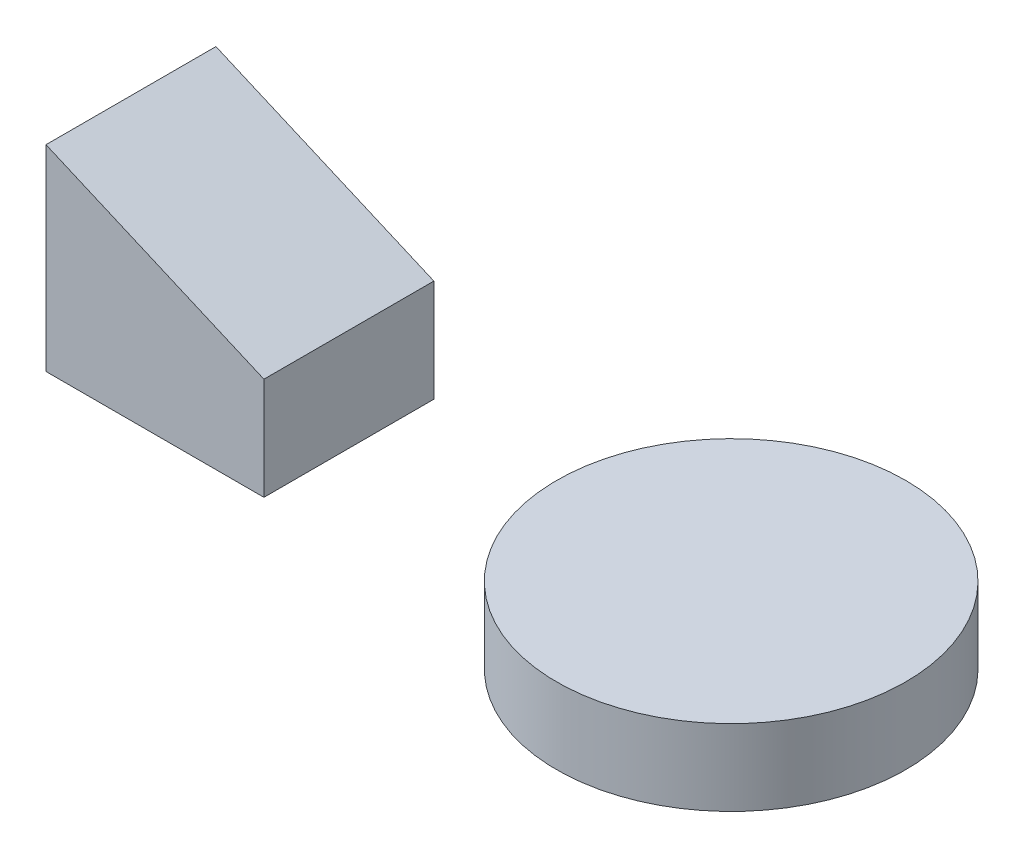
ISO-10303-21;
HEADER;
FILE_DESCRIPTION(('STEP AP214'),'2;1');
FILE_NAME('part.step','',(''),(''),'','','');
FILE_SCHEMA(('AUTOMOTIVE_DESIGN { 1 0 10303 214 1 1 1 1 }'));
ENDSEC;
DATA;
#1=APPLICATION_CONTEXT('core data for automotive mechanical design processes');
#2=APPLICATION_PROTOCOL_DEFINITION('international standard','automotive_design',2000,#1);
#3=PRODUCT_CONTEXT('',#1,'mechanical');
#4=PRODUCT('Part','Part','',(#3));
#5=PRODUCT_RELATED_PRODUCT_CATEGORY('part','',(#4));
#6=PRODUCT_DEFINITION_FORMATION('','',#4);
#7=PRODUCT_DEFINITION_CONTEXT('part definition',#1,'design');
#8=PRODUCT_DEFINITION('design','',#6,#7);
#9=PRODUCT_DEFINITION_SHAPE('','',#8);
#10=(LENGTH_UNIT() NAMED_UNIT(*) SI_UNIT(.MILLI.,.METRE.));
#11=(NAMED_UNIT(*) PLANE_ANGLE_UNIT() SI_UNIT($,.RADIAN.));
#12=(NAMED_UNIT(*) SI_UNIT($,.STERADIAN.) SOLID_ANGLE_UNIT());
#13=UNCERTAINTY_MEASURE_WITH_UNIT(LENGTH_MEASURE(1.E-05),#10,'distance_accuracy_value','');
#14=(GEOMETRIC_REPRESENTATION_CONTEXT(3) GLOBAL_UNCERTAINTY_ASSIGNED_CONTEXT((#13)) GLOBAL_UNIT_ASSIGNED_CONTEXT((#10,
#11,#12)) REPRESENTATION_CONTEXT('',''));
#15=CARTESIAN_POINT('',(0.,0.,0.));
#16=DIRECTION('',(0.,0.,1.));
#17=DIRECTION('',(1.,0.,0.));
#18=AXIS2_PLACEMENT_3D('',#15,#16,#17);
#19=CARTESIAN_POINT('',(342.699060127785,43.434,48.514));
#20=DIRECTION('',(0.,-1.,0.));
#21=DIRECTION('',(0.,0.,-1.));
#22=AXIS2_PLACEMENT_3D('',#19,#20,#21);
#23=CYLINDRICAL_SURFACE('',#22,99.6579271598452);
#24=CARTESIAN_POINT('',(342.699060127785,43.434,48.514));
#25=DIRECTION('',(0.,1.,0.));
#26=DIRECTION('',(0.,0.,1.));
#27=AXIS2_PLACEMENT_3D('',#24,#25,#26);
#28=CIRCLE('',#27,99.6579271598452);
#29=CARTESIAN_POINT('',(342.699060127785,43.434,-51.1439271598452));
#30=VERTEX_POINT('',#29);
#31=EDGE_CURVE('E11',#30,#30,#28,.T.);
#32=CARTESIAN_POINT('',(342.699060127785,0.,48.514));
#33=DIRECTION('',(0.,1.,0.));
#34=DIRECTION('',(0.,0.,1.));
#35=AXIS2_PLACEMENT_3D('',#32,#33,#34);
#36=CIRCLE('',#35,99.6579271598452);
#37=CARTESIAN_POINT('',(342.699060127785,0.,-51.1439271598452));
#38=VERTEX_POINT('',#37);
#39=EDGE_CURVE('E42',#38,#38,#36,.T.);
#40=CARTESIAN_POINT('',(342.699060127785,43.434,-51.1439271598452));
#41=CARTESIAN_POINT('',(342.699060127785,42.9815625,-51.1439271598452));
#42=CARTESIAN_POINT('',(342.699060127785,42.529125,-51.1439271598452));
#43=CARTESIAN_POINT('',(342.699060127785,41.62425,-51.1439271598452));
#44=CARTESIAN_POINT('',(342.699060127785,41.1718125,-51.1439271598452));
#45=CARTESIAN_POINT('',(342.699060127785,40.2669375,-51.1439271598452));
#46=CARTESIAN_POINT('',(342.699060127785,39.8145,-51.1439271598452));
#47=CARTESIAN_POINT('',(342.699060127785,38.909625,-51.1439271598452));
#48=CARTESIAN_POINT('',(342.699060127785,38.4571875,-51.1439271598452));
#49=CARTESIAN_POINT('',(342.699060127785,37.5523125,-51.1439271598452));
#50=CARTESIAN_POINT('',(342.699060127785,37.099875,-51.1439271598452));
#51=CARTESIAN_POINT('',(342.699060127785,36.195,-51.1439271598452));
#52=CARTESIAN_POINT('',(342.699060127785,35.7425625,-51.1439271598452));
#53=CARTESIAN_POINT('',(342.699060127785,34.8376875,-51.1439271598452));
#54=CARTESIAN_POINT('',(342.699060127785,34.38525,-51.1439271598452));
#55=CARTESIAN_POINT('',(342.699060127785,33.480375,-51.1439271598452));
#56=CARTESIAN_POINT('',(342.699060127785,33.0279375,-51.1439271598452));
#57=CARTESIAN_POINT('',(342.699060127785,32.1230625,-51.1439271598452));
#58=CARTESIAN_POINT('',(342.699060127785,31.670625,-51.1439271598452));
#59=CARTESIAN_POINT('',(342.699060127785,30.76575,-51.1439271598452));
#60=CARTESIAN_POINT('',(342.699060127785,30.3133125,-51.1439271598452));
#61=CARTESIAN_POINT('',(342.699060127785,29.4084375,-51.1439271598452));
#62=CARTESIAN_POINT('',(342.699060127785,28.956,-51.1439271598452));
#63=CARTESIAN_POINT('',(342.699060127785,28.051125,-51.1439271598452));
#64=CARTESIAN_POINT('',(342.699060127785,27.5986875,-51.1439271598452));
#65=CARTESIAN_POINT('',(342.699060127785,26.6938125,-51.1439271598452));
#66=CARTESIAN_POINT('',(342.699060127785,26.241375,-51.1439271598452));
#67=CARTESIAN_POINT('',(342.699060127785,25.3365,-51.1439271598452));
#68=CARTESIAN_POINT('',(342.699060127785,24.8840625,-51.1439271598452));
#69=CARTESIAN_POINT('',(342.699060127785,23.9791875,-51.1439271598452));
#70=CARTESIAN_POINT('',(342.699060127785,23.52675,-51.1439271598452));
#71=CARTESIAN_POINT('',(342.699060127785,22.621875,-51.1439271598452));
#72=CARTESIAN_POINT('',(342.699060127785,22.1694375,-51.1439271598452));
#73=CARTESIAN_POINT('',(342.699060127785,21.2645625,-51.1439271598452));
#74=CARTESIAN_POINT('',(342.699060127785,20.812125,-51.1439271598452));
#75=CARTESIAN_POINT('',(342.699060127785,19.90725,-51.1439271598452));
#76=CARTESIAN_POINT('',(342.699060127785,19.4548125,-51.1439271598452));
#77=CARTESIAN_POINT('',(342.699060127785,18.5499375,-51.1439271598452));
#78=CARTESIAN_POINT('',(342.699060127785,18.0975,-51.1439271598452));
#79=CARTESIAN_POINT('',(342.699060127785,17.192625,-51.1439271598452));
#80=CARTESIAN_POINT('',(342.699060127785,16.7401875,-51.1439271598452));
#81=CARTESIAN_POINT('',(342.699060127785,15.8353125,-51.1439271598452));
#82=CARTESIAN_POINT('',(342.699060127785,15.382875,-51.1439271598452));
#83=CARTESIAN_POINT('',(342.699060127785,14.478,-51.1439271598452));
#84=CARTESIAN_POINT('',(342.699060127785,14.0255625,-51.1439271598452));
#85=CARTESIAN_POINT('',(342.699060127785,13.1206875,-51.1439271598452));
#86=CARTESIAN_POINT('',(342.699060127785,12.66825,-51.1439271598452));
#87=CARTESIAN_POINT('',(342.699060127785,11.763375,-51.1439271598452));
#88=CARTESIAN_POINT('',(342.699060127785,11.3109375,-51.1439271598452));
#89=CARTESIAN_POINT('',(342.699060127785,10.4060625,-51.1439271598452));
#90=CARTESIAN_POINT('',(342.699060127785,9.953625,-51.1439271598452));
#91=CARTESIAN_POINT('',(342.699060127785,9.04875,-51.1439271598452));
#92=CARTESIAN_POINT('',(342.699060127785,8.5963125,-51.1439271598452));
#93=CARTESIAN_POINT('',(342.699060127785,7.69143749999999,-51.1439271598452));
#94=CARTESIAN_POINT('',(342.699060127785,7.239,-51.1439271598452));
#95=CARTESIAN_POINT('',(342.699060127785,6.334125,-51.1439271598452));
#96=CARTESIAN_POINT('',(342.699060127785,5.8816875,-51.1439271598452));
#97=CARTESIAN_POINT('',(342.699060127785,4.9768125,-51.1439271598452));
#98=CARTESIAN_POINT('',(342.699060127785,4.524375,-51.1439271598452));
#99=CARTESIAN_POINT('',(342.699060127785,3.6195,-51.1439271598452));
#100=CARTESIAN_POINT('',(342.699060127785,3.16706249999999,-51.1439271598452));
#101=CARTESIAN_POINT('',(342.699060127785,2.26218749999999,-51.1439271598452));
#102=CARTESIAN_POINT('',(342.699060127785,1.80974999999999,-51.1439271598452));
#103=CARTESIAN_POINT('',(342.699060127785,0.904874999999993,-51.1439271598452));
#104=CARTESIAN_POINT('',(342.699060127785,0.452437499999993,-51.1439271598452));
#105=CARTESIAN_POINT('',(342.699060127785,0.,-51.1439271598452));
#106=B_SPLINE_CURVE_WITH_KNOTS('',3,(#40,#41,#42,#43,#44,#45,#46,#47,#48,#49,#50,#51,#52,#53,
#54,#55,#56,#57,#58,#59,#60,#61,#62,#63,#64,#65,#66,#67,#68,#69,#70,#71,#72,#73,#74,#75,#76,#77,
#78,#79,#80,#81,#82,#83,#84,#85,#86,#87,#88,#89,#90,#91,#92,#93,#94,#95,#96,#97,#98,#99,#100,
#101,#102,#103,#104,#105),.UNSPECIFIED.,.F.,.F.,(4,2,2,2,2,2,2,2,2,2,2,2,2,2,2,2,2,2,2,2,2,2,2,
2,2,2,2,2,2,2,2,2,4),(0.,1.3573125,2.714625,4.0719375,5.42925,6.7865625,8.143875,9.5011875,
10.8585,12.2158125,13.573125,14.9304375,16.28775,17.6450625,19.002375,20.3596875,21.717,
23.0743125,24.431625,25.7889375,27.14625,28.5035625,29.860875,31.2181875,32.5755,33.9328125,
35.290125,36.6474375,38.00475,39.3620625,40.719375,42.0766875,43.434),.UNSPECIFIED.);
#107=EDGE_CURVE('BSEAM39',#30,#38,#106,.T.);
#108=ORIENTED_EDGE('',*,*,#31,.F.);
#109=ORIENTED_EDGE('',*,*,#39,.T.);
#110=ORIENTED_EDGE('',*,*,#107,.T.);
#111=ORIENTED_EDGE('',*,*,#107,.F.);
#112=EDGE_LOOP('',(#108,#110,#109,#111));
#113=FACE_BOUND('',#112,.T.);
#114=ADVANCED_FACE('F39',(#113),#23,.T.);
#115=CARTESIAN_POINT('',(342.699060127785,43.434,48.514));
#116=DIRECTION('',(0.,1.,0.));
#117=DIRECTION('',(0.,0.,1.));
#118=AXIS2_PLACEMENT_3D('',#115,#116,#117);
#119=PLANE('',#118);
#120=ORIENTED_EDGE('',*,*,#31,.T.);
#121=EDGE_LOOP('',(#120));
#122=FACE_BOUND('',#121,.T.);
#123=ADVANCED_FACE('F54',(#122),#119,.T.);
#124=CARTESIAN_POINT('',(342.699060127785,0.,48.514));
#125=DIRECTION('',(0.,1.,0.));
#126=DIRECTION('',(0.,0.,1.));
#127=AXIS2_PLACEMENT_3D('',#124,#125,#126);
#128=PLANE('',#127);
#129=ORIENTED_EDGE('',*,*,#39,.F.);
#130=EDGE_LOOP('',(#129));
#131=FACE_BOUND('',#130,.T.);
#132=ADVANCED_FACE('F52',(#131),#128,.F.);
#133=CLOSED_SHELL('',(#114,#123,#132));
#134=MANIFOLD_SOLID_BREP('B2',#133);
#135=CARTESIAN_POINT('',(0.,0.,97.028));
#136=DIRECTION('',(1.,0.,0.));
#137=DIRECTION('',(0.,0.,-1.));
#138=AXIS2_PLACEMENT_3D('',#135,#136,#137);
#139=PLANE('',#138);
#140=DIRECTION('',(0.,-1.,0.));
#141=VECTOR('',#140,1.);
#142=CARTESIAN_POINT('',(0.,0.,0.));
#143=LINE('',#142,#141);
#144=CARTESIAN_POINT('',(0.,112.167883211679,0.));
#145=VERTEX_POINT('',#144);
#146=CARTESIAN_POINT('',(0.,0.,0.));
#147=VERTEX_POINT('',#146);
#148=EDGE_CURVE('E143',#145,#147,#143,.T.);
#149=ORIENTED_EDGE('',*,*,#148,.T.);
#150=DIRECTION('',(0.,0.,-1.));
#151=VECTOR('',#150,1.);
#152=CARTESIAN_POINT('',(0.,0.,97.028));
#153=LINE('',#152,#151);
#154=CARTESIAN_POINT('',(0.,0.,97.028));
#155=VERTEX_POINT('',#154);
#156=EDGE_CURVE('E37',#155,#147,#153,.T.);
#157=ORIENTED_EDGE('',*,*,#156,.F.);
#158=DIRECTION('',(0.,-1.,0.));
#159=VECTOR('',#158,1.);
#160=CARTESIAN_POINT('',(0.,0.,97.028));
#161=LINE('',#160,#159);
#162=CARTESIAN_POINT('',(0.,112.167883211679,97.028));
#163=VERTEX_POINT('',#162);
#164=EDGE_CURVE('E131',#163,#155,#161,.T.);
#165=ORIENTED_EDGE('',*,*,#164,.F.);
#166=DIRECTION('',(0.,0.,-1.));
#167=VECTOR('',#166,1.);
#168=CARTESIAN_POINT('',(0.,112.167883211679,97.028));
#169=LINE('',#168,#167);
#170=EDGE_CURVE('E139',#163,#145,#169,.T.);
#171=ORIENTED_EDGE('',*,*,#170,.T.);
#172=EDGE_LOOP('',(#149,#157,#165,#171));
#173=FACE_BOUND('',#172,.T.);
#174=ADVANCED_FACE('F80',(#173),#139,.F.);
#175=CARTESIAN_POINT('',(0.,0.,97.028));
#176=DIRECTION('',(0.,1.,0.));
#177=DIRECTION('',(0.,0.,1.));
#178=AXIS2_PLACEMENT_3D('',#175,#176,#177);
#179=PLANE('',#178);
#180=DIRECTION('',(1.,0.,0.));
#181=VECTOR('',#180,1.);
#182=CARTESIAN_POINT('',(0.,0.,0.));
#183=LINE('',#182,#181);
#184=CARTESIAN_POINT('',(124.432199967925,0.,0.));
#185=VERTEX_POINT('',#184);
#186=EDGE_CURVE('E135',#147,#185,#183,.T.);
#187=ORIENTED_EDGE('',*,*,#186,.T.);
#188=DIRECTION('',(0.,0.,-1.));
#189=VECTOR('',#188,1.);
#190=CARTESIAN_POINT('',(124.432199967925,0.,97.028));
#191=LINE('',#190,#189);
#192=CARTESIAN_POINT('',(124.432199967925,0.,97.028));
#193=VERTEX_POINT('',#192);
#194=EDGE_CURVE('E88',#193,#185,#191,.T.);
#195=ORIENTED_EDGE('',*,*,#194,.F.);
#196=DIRECTION('',(1.,0.,0.));
#197=VECTOR('',#196,1.);
#198=CARTESIAN_POINT('',(0.,0.,97.028));
#199=LINE('',#198,#197);
#200=EDGE_CURVE('E126',#155,#193,#199,.T.);
#201=ORIENTED_EDGE('',*,*,#200,.F.);
#202=ORIENTED_EDGE('',*,*,#156,.T.);
#203=EDGE_LOOP('',(#187,#195,#201,#202));
#204=FACE_BOUND('',#203,.T.);
#205=ADVANCED_FACE('F134',(#204),#179,.F.);
#206=CARTESIAN_POINT('',(124.432199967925,0.,97.028));
#207=DIRECTION('',(-1.,0.,0.));
#208=DIRECTION('',(0.,0.,1.));
#209=AXIS2_PLACEMENT_3D('',#206,#207,#208);
#210=PLANE('',#209);
#211=DIRECTION('',(0.,1.,0.));
#212=VECTOR('',#211,1.);
#213=CARTESIAN_POINT('',(124.432199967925,0.,0.));
#214=LINE('',#213,#212);
#215=CARTESIAN_POINT('',(124.432199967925,58.4279722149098,0.));
#216=VERTEX_POINT('',#215);
#217=EDGE_CURVE('E113',#185,#216,#214,.T.);
#218=ORIENTED_EDGE('',*,*,#217,.T.);
#219=DIRECTION('',(0.,0.,-1.));
#220=VECTOR('',#219,1.);
#221=CARTESIAN_POINT('',(124.432199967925,58.4279722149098,97.028));
#222=LINE('',#221,#220);
#223=CARTESIAN_POINT('',(124.432199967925,58.4279722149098,97.028));
#224=VERTEX_POINT('',#223);
#225=EDGE_CURVE('E136',#224,#216,#222,.T.);
#226=ORIENTED_EDGE('',*,*,#225,.F.);
#227=DIRECTION('',(0.,1.,0.));
#228=VECTOR('',#227,1.);
#229=CARTESIAN_POINT('',(124.432199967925,0.,97.028));
#230=LINE('',#229,#228);
#231=EDGE_CURVE('E129',#193,#224,#230,.T.);
#232=ORIENTED_EDGE('',*,*,#231,.F.);
#233=ORIENTED_EDGE('',*,*,#194,.T.);
#234=EDGE_LOOP('',(#218,#226,#232,#233));
#235=FACE_BOUND('',#234,.T.);
#236=ADVANCED_FACE('F137',(#235),#210,.F.);
#237=CARTESIAN_POINT('',(0.,112.167883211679,97.028));
#238=DIRECTION('',(-0.396484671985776,-0.918041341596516,0.));
#239=DIRECTION('',(0.918041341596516,-0.396484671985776,0.));
#240=AXIS2_PLACEMENT_3D('',#237,#238,#239);
#241=PLANE('',#240);
#242=DIRECTION('',(-0.918041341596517,0.396484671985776,0.));
#243=VECTOR('',#242,1.);
#244=CARTESIAN_POINT('',(0.,112.167883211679,0.));
#245=LINE('',#244,#243);
#246=EDGE_CURVE('E119',#216,#145,#245,.T.);
#247=ORIENTED_EDGE('',*,*,#246,.T.);
#248=ORIENTED_EDGE('',*,*,#170,.F.);
#249=DIRECTION('',(-0.918041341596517,0.396484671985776,0.));
#250=VECTOR('',#249,1.);
#251=CARTESIAN_POINT('',(0.,112.167883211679,97.028));
#252=LINE('',#251,#250);
#253=EDGE_CURVE('E96',#224,#163,#252,.T.);
#254=ORIENTED_EDGE('',*,*,#253,.F.);
#255=ORIENTED_EDGE('',*,*,#225,.T.);
#256=EDGE_LOOP('',(#247,#248,#254,#255));
#257=FACE_BOUND('',#256,.T.);
#258=ADVANCED_FACE('F150',(#257),#241,.F.);
#259=CARTESIAN_POINT('',(0.,0.,97.028));
#260=DIRECTION('',(0.,0.,-1.));
#261=DIRECTION('',(-1.,0.,0.));
#262=AXIS2_PLACEMENT_3D('',#259,#260,#261);
#263=PLANE('',#262);
#264=ORIENTED_EDGE('',*,*,#164,.T.);
#265=ORIENTED_EDGE('',*,*,#200,.T.);
#266=ORIENTED_EDGE('',*,*,#231,.T.);
#267=ORIENTED_EDGE('',*,*,#253,.T.);
#268=EDGE_LOOP('',(#264,#265,#266,#267));
#269=FACE_BOUND('',#268,.T.);
#270=ADVANCED_FACE('F127',(#269),#263,.F.);
#271=CARTESIAN_POINT('',(0.,0.,0.));
#272=DIRECTION('',(0.,0.,-1.));
#273=DIRECTION('',(-1.,0.,0.));
#274=AXIS2_PLACEMENT_3D('',#271,#272,#273);
#275=PLANE('',#274);
#276=ORIENTED_EDGE('',*,*,#148,.F.);
#277=ORIENTED_EDGE('',*,*,#246,.F.);
#278=ORIENTED_EDGE('',*,*,#217,.F.);
#279=ORIENTED_EDGE('',*,*,#186,.F.);
#280=EDGE_LOOP('',(#276,#277,#278,#279));
#281=FACE_BOUND('',#280,.T.);
#282=ADVANCED_FACE('F153',(#281),#275,.T.);
#283=CLOSED_SHELL('',(#174,#205,#236,#258,#270,#282));
#284=MANIFOLD_SOLID_BREP('B6',#283);
#285=ADVANCED_BREP_SHAPE_REPRESENTATION('',(#18,#134,#284),#14);
#286=SHAPE_DEFINITION_REPRESENTATION(#9,#285);
ENDSEC;
END-ISO-10303-21;
